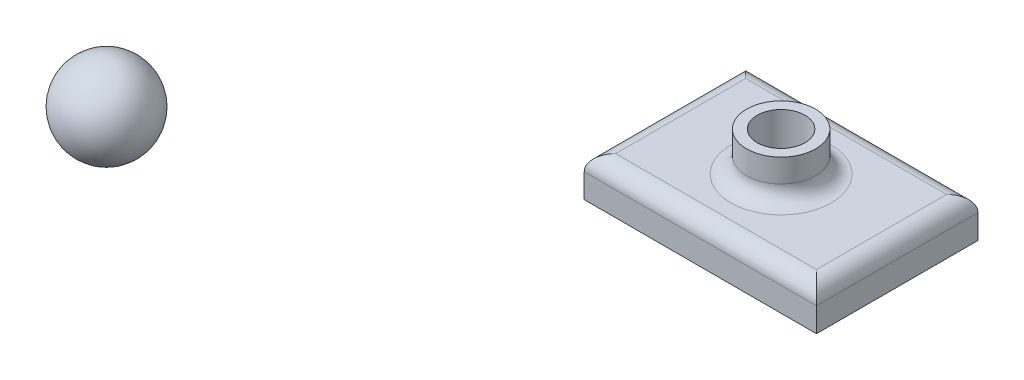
ISO-10303-21;
HEADER;
FILE_DESCRIPTION(('STEP AP214'),'2;1');
FILE_NAME('part.step','',(''),(''),'','','');
FILE_SCHEMA(('AUTOMOTIVE_DESIGN { 1 0 10303 214 1 1 1 1 }'));
ENDSEC;
DATA;
#1=APPLICATION_CONTEXT('core data for automotive mechanical design processes');
#2=APPLICATION_PROTOCOL_DEFINITION('international standard','automotive_design',2000,#1);
#3=PRODUCT_CONTEXT('',#1,'mechanical');
#4=PRODUCT('Part','Part','',(#3));
#5=PRODUCT_RELATED_PRODUCT_CATEGORY('part','',(#4));
#6=PRODUCT_DEFINITION_FORMATION('','',#4);
#7=PRODUCT_DEFINITION_CONTEXT('part definition',#1,'design');
#8=PRODUCT_DEFINITION('design','',#6,#7);
#9=PRODUCT_DEFINITION_SHAPE('','',#8);
#10=(LENGTH_UNIT() NAMED_UNIT(*) SI_UNIT(.MILLI.,.METRE.));
#11=(NAMED_UNIT(*) PLANE_ANGLE_UNIT() SI_UNIT($,.RADIAN.));
#12=(NAMED_UNIT(*) SI_UNIT($,.STERADIAN.) SOLID_ANGLE_UNIT());
#13=UNCERTAINTY_MEASURE_WITH_UNIT(LENGTH_MEASURE(1.E-05),#10,'distance_accuracy_value','');
#14=(GEOMETRIC_REPRESENTATION_CONTEXT(3) GLOBAL_UNCERTAINTY_ASSIGNED_CONTEXT((#13)) GLOBAL_UNIT_ASSIGNED_CONTEXT((#10,
#11,#12)) REPRESENTATION_CONTEXT('',''));
#15=CARTESIAN_POINT('',(0.,0.,0.));
#16=DIRECTION('',(0.,0.,1.));
#17=DIRECTION('',(1.,0.,0.));
#18=AXIS2_PLACEMENT_3D('',#15,#16,#17);
#19=CARTESIAN_POINT('',(223.466392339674,32.258,-293.233369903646));
#20=DIRECTION('',(0.,-1.,0.));
#21=DIRECTION('',(0.,0.,-1.));
#22=AXIS2_PLACEMENT_3D('',#19,#20,#21);
#23=PLANE('',#22);
#24=CARTESIAN_POINT('',(317.335366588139,32.258,-227.948089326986));
#25=DIRECTION('',(0.,-1.,0.));
#26=DIRECTION('',(0.,0.,-1.));
#27=AXIS2_PLACEMENT_3D('',#24,#25,#26);
#28=CIRCLE('',#27,40.5617104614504);
#29=CARTESIAN_POINT('',(317.335366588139,32.258,-268.509799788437));
#30=VERTEX_POINT('',#29);
#31=EDGE_CURVE('E136',#30,#30,#28,.T.);
#32=ORIENTED_EDGE('',*,*,#31,.T.);
#33=EDGE_LOOP('',(#32));
#34=FACE_BOUND('',#33,.T.);
#35=DIRECTION('',(0.,0.,-1.));
#36=VECTOR('',#35,1.);
#37=CARTESIAN_POINT('',(398.504340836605,32.258,-293.233369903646));
#38=LINE('',#37,#36);
#39=CARTESIAN_POINT('',(398.504340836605,32.258,-175.362808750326));
#40=VERTEX_POINT('',#39);
#41=CARTESIAN_POINT('',(398.504340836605,32.258,-280.533369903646));
#42=VERTEX_POINT('',#41);
#43=EDGE_CURVE('E131',#40,#42,#38,.T.);
#44=ORIENTED_EDGE('',*,*,#43,.T.);
#45=DIRECTION('',(-1.,0.,0.));
#46=VECTOR('',#45,1.);
#47=CARTESIAN_POINT('',(223.466392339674,32.258,-280.533369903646));
#48=LINE('',#47,#46);
#49=CARTESIAN_POINT('',(236.166392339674,32.258,-280.533369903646));
#50=VERTEX_POINT('',#49);
#51=EDGE_CURVE('E133',#42,#50,#48,.T.);
#52=ORIENTED_EDGE('',*,*,#51,.T.);
#53=DIRECTION('',(0.,0.,1.));
#54=VECTOR('',#53,1.);
#55=CARTESIAN_POINT('',(236.166392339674,32.258,-293.233369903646));
#56=LINE('',#55,#54);
#57=CARTESIAN_POINT('',(236.166392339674,32.258,-175.362808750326));
#58=VERTEX_POINT('',#57);
#59=EDGE_CURVE('E127',#50,#58,#56,.T.);
#60=ORIENTED_EDGE('',*,*,#59,.T.);
#61=DIRECTION('',(1.,0.,0.));
#62=VECTOR('',#61,1.);
#63=CARTESIAN_POINT('',(223.466392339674,32.258,-175.362808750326));
#64=LINE('',#63,#62);
#65=EDGE_CURVE('E129',#58,#40,#64,.T.);
#66=ORIENTED_EDGE('',*,*,#65,.T.);
#67=EDGE_LOOP('',(#44,#52,#60,#66));
#68=FACE_BOUND('',#67,.T.);
#69=ADVANCED_FACE('F37',(#34,#68),#23,.F.);
#70=CARTESIAN_POINT('',(223.466392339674,32.258,-162.662808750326));
#71=DIRECTION('',(1.,0.,0.));
#72=DIRECTION('',(0.,0.,-1.));
#73=AXIS2_PLACEMENT_3D('',#70,#71,#72);
#74=PLANE('',#73);
#75=DIRECTION('',(0.,-1.,0.));
#76=VECTOR('',#75,1.);
#77=CARTESIAN_POINT('',(223.466392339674,32.258,-162.662808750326));
#78=LINE('',#77,#76);
#79=CARTESIAN_POINT('',(223.466392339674,19.558,-162.662808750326));
#80=VERTEX_POINT('',#79);
#81=CARTESIAN_POINT('',(223.466392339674,0.,-162.662808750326));
#82=VERTEX_POINT('',#81);
#83=EDGE_CURVE('E89',#80,#82,#78,.T.);
#84=ORIENTED_EDGE('',*,*,#83,.F.);
#85=DIRECTION('',(0.,0.,1.));
#86=VECTOR('',#85,1.);
#87=CARTESIAN_POINT('',(223.466392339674,19.558,-162.662808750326));
#88=LINE('',#87,#86);
#89=CARTESIAN_POINT('',(223.466392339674,19.558,-293.233369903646));
#90=VERTEX_POINT('',#89);
#91=EDGE_CURVE('E12',#80,#90,#88,.F.);
#92=ORIENTED_EDGE('',*,*,#91,.T.);
#93=DIRECTION('',(0.,-1.,0.));
#94=VECTOR('',#93,1.);
#95=CARTESIAN_POINT('',(223.466392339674,32.258,-293.233369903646));
#96=LINE('',#95,#94);
#97=CARTESIAN_POINT('',(223.466392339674,0.,-293.233369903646));
#98=VERTEX_POINT('',#97);
#99=EDGE_CURVE('E110',#90,#98,#96,.T.);
#100=ORIENTED_EDGE('',*,*,#99,.T.);
#101=DIRECTION('',(0.,0.,1.));
#102=VECTOR('',#101,1.);
#103=CARTESIAN_POINT('',(223.466392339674,0.,-162.662808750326));
#104=LINE('',#103,#102);
#105=EDGE_CURVE('E104',#98,#82,#104,.T.);
#106=ORIENTED_EDGE('',*,*,#105,.T.);
#107=EDGE_LOOP('',(#84,#92,#100,#106));
#108=FACE_BOUND('',#107,.T.);
#109=ADVANCED_FACE('F108',(#108),#74,.F.);
#110=CARTESIAN_POINT('',(223.466392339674,32.258,-162.662808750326));
#111=DIRECTION('',(0.,0.,-1.));
#112=DIRECTION('',(-1.,0.,0.));
#113=AXIS2_PLACEMENT_3D('',#110,#111,#112);
#114=PLANE('',#113);
#115=DIRECTION('',(0.,-1.,0.));
#116=VECTOR('',#115,1.);
#117=CARTESIAN_POINT('',(411.204340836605,32.258,-162.662808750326));
#118=LINE('',#117,#116);
#119=CARTESIAN_POINT('',(411.204340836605,19.558,-162.662808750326));
#120=VERTEX_POINT('',#119);
#121=CARTESIAN_POINT('',(411.204340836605,0.,-162.662808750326));
#122=VERTEX_POINT('',#121);
#123=EDGE_CURVE('E98',#120,#122,#118,.T.);
#124=ORIENTED_EDGE('',*,*,#123,.F.);
#125=DIRECTION('',(1.,0.,0.));
#126=VECTOR('',#125,1.);
#127=CARTESIAN_POINT('',(223.466392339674,19.558,-162.662808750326));
#128=LINE('',#127,#126);
#129=EDGE_CURVE('E46',#120,#80,#128,.F.);
#130=ORIENTED_EDGE('',*,*,#129,.T.);
#131=ORIENTED_EDGE('',*,*,#83,.T.);
#132=DIRECTION('',(1.,0.,0.));
#133=VECTOR('',#132,1.);
#134=CARTESIAN_POINT('',(223.466392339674,0.,-162.662808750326));
#135=LINE('',#134,#133);
#136=EDGE_CURVE('E92',#82,#122,#135,.T.);
#137=ORIENTED_EDGE('',*,*,#136,.T.);
#138=EDGE_LOOP('',(#124,#130,#131,#137));
#139=FACE_BOUND('',#138,.T.);
#140=ADVANCED_FACE('F91',(#139),#114,.F.);
#141=CARTESIAN_POINT('',(411.204340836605,32.258,-162.662808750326));
#142=DIRECTION('',(-1.,0.,0.));
#143=DIRECTION('',(0.,0.,1.));
#144=AXIS2_PLACEMENT_3D('',#141,#142,#143);
#145=PLANE('',#144);
#146=DIRECTION('',(0.,-1.,0.));
#147=VECTOR('',#146,1.);
#148=CARTESIAN_POINT('',(411.204340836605,32.258,-293.233369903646));
#149=LINE('',#148,#147);
#150=CARTESIAN_POINT('',(411.204340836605,19.558,-293.233369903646));
#151=VERTEX_POINT('',#150);
#152=CARTESIAN_POINT('',(411.204340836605,0.,-293.233369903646));
#153=VERTEX_POINT('',#152);
#154=EDGE_CURVE('E122',#151,#153,#149,.T.);
#155=ORIENTED_EDGE('',*,*,#154,.F.);
#156=DIRECTION('',(0.,0.,-1.));
#157=VECTOR('',#156,1.);
#158=CARTESIAN_POINT('',(411.204340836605,19.558,-162.662808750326));
#159=LINE('',#158,#157);
#160=EDGE_CURVE('E61',#151,#120,#159,.F.);
#161=ORIENTED_EDGE('',*,*,#160,.T.);
#162=ORIENTED_EDGE('',*,*,#123,.T.);
#163=DIRECTION('',(0.,0.,-1.));
#164=VECTOR('',#163,1.);
#165=CARTESIAN_POINT('',(411.204340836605,0.,-162.662808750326));
#166=LINE('',#165,#164);
#167=EDGE_CURVE('E106',#122,#153,#166,.T.);
#168=ORIENTED_EDGE('',*,*,#167,.T.);
#169=EDGE_LOOP('',(#155,#161,#162,#168));
#170=FACE_BOUND('',#169,.T.);
#171=ADVANCED_FACE('F185',(#170),#145,.F.);
#172=CARTESIAN_POINT('',(223.466392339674,32.258,-293.233369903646));
#173=DIRECTION('',(0.,0.,1.));
#174=DIRECTION('',(1.,0.,0.));
#175=AXIS2_PLACEMENT_3D('',#172,#173,#174);
#176=PLANE('',#175);
#177=ORIENTED_EDGE('',*,*,#99,.F.);
#178=DIRECTION('',(-1.,0.,0.));
#179=VECTOR('',#178,1.);
#180=CARTESIAN_POINT('',(223.466392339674,19.558,-293.233369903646));
#181=LINE('',#180,#179);
#182=EDGE_CURVE('E139',#90,#151,#181,.F.);
#183=ORIENTED_EDGE('',*,*,#182,.T.);
#184=ORIENTED_EDGE('',*,*,#154,.T.);
#185=DIRECTION('',(-1.,0.,0.));
#186=VECTOR('',#185,1.);
#187=CARTESIAN_POINT('',(223.466392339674,0.,-293.233369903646));
#188=LINE('',#187,#186);
#189=EDGE_CURVE('E119',#153,#98,#188,.T.);
#190=ORIENTED_EDGE('',*,*,#189,.T.);
#191=EDGE_LOOP('',(#177,#183,#184,#190));
#192=FACE_BOUND('',#191,.T.);
#193=ADVANCED_FACE('F165',(#192),#176,.F.);
#194=CARTESIAN_POINT('',(223.466392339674,0.,-293.233369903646));
#195=DIRECTION('',(0.,-1.,0.));
#196=DIRECTION('',(0.,0.,-1.));
#197=AXIS2_PLACEMENT_3D('',#194,#195,#196);
#198=PLANE('',#197);
#199=ORIENTED_EDGE('',*,*,#105,.F.);
#200=ORIENTED_EDGE('',*,*,#189,.F.);
#201=ORIENTED_EDGE('',*,*,#167,.F.);
#202=ORIENTED_EDGE('',*,*,#136,.F.);
#203=EDGE_LOOP('',(#199,#200,#201,#202));
#204=FACE_BOUND('',#203,.T.);
#205=ADVANCED_FACE('F102',(#204),#198,.T.);
#206=CARTESIAN_POINT('',(317.335366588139,63.754,-227.948089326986));
#207=DIRECTION('',(0.,-1.,0.));
#208=DIRECTION('',(0.,0.,-1.));
#209=AXIS2_PLACEMENT_3D('',#206,#207,#208);
#210=CYLINDRICAL_SURFACE('',#209,27.8617104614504);
#211=CARTESIAN_POINT('',(317.335366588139,44.958,-227.948089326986));
#212=DIRECTION('',(0.,-1.,0.));
#213=DIRECTION('',(0.,0.,-1.));
#214=AXIS2_PLACEMENT_3D('',#211,#212,#213);
#215=CIRCLE('',#214,27.8617104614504);
#216=CARTESIAN_POINT('',(317.335366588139,44.958,-255.809799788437));
#217=VERTEX_POINT('',#216);
#218=EDGE_CURVE('E97',#217,#217,#215,.F.);
#219=ORIENTED_EDGE('',*,*,#218,.T.);
#220=EDGE_LOOP('',(#219));
#221=FACE_BOUND('',#220,.T.);
#222=CARTESIAN_POINT('',(317.335366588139,63.754,-227.948089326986));
#223=DIRECTION('',(0.,1.,0.));
#224=DIRECTION('',(0.,0.,1.));
#225=AXIS2_PLACEMENT_3D('',#222,#223,#224);
#226=CIRCLE('',#225,27.8617104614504);
#227=CARTESIAN_POINT('',(317.335366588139,63.754,-200.086378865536));
#228=VERTEX_POINT('',#227);
#229=EDGE_CURVE('E112',#228,#228,#226,.T.);
#230=ORIENTED_EDGE('',*,*,#229,.F.);
#231=EDGE_LOOP('',(#230));
#232=FACE_BOUND('',#231,.T.);
#233=ADVANCED_FACE('F179',(#221,#232),#210,.T.);
#234=CARTESIAN_POINT('',(317.335366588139,63.754,-227.948089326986));
#235=DIRECTION('',(0.,1.,0.));
#236=DIRECTION('',(0.,0.,1.));
#237=AXIS2_PLACEMENT_3D('',#234,#235,#236);
#238=PLANE('',#237);
#239=CARTESIAN_POINT('',(317.335366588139,63.754,-227.948089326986));
#240=DIRECTION('',(0.,1.,0.));
#241=DIRECTION('',(0.,0.,1.));
#242=AXIS2_PLACEMENT_3D('',#239,#240,#241);
#243=CIRCLE('',#242,19.2848985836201);
#244=CARTESIAN_POINT('',(317.335366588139,63.754,-208.663190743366));
#245=VERTEX_POINT('',#244);
#246=EDGE_CURVE('E296',#245,#245,#243,.T.);
#247=ORIENTED_EDGE('',*,*,#246,.F.);
#248=EDGE_LOOP('',(#247));
#249=FACE_BOUND('',#248,.T.);
#250=ORIENTED_EDGE('',*,*,#229,.T.);
#251=EDGE_LOOP('',(#250));
#252=FACE_BOUND('',#251,.T.);
#253=ADVANCED_FACE('F193',(#249,#252),#238,.T.);
#254=CARTESIAN_POINT('',(317.335366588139,44.958,-227.948089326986));
#255=DIRECTION('',(0.,-1.,0.));
#256=DIRECTION('',(0.,0.,-1.));
#257=AXIS2_PLACEMENT_3D('',#254,#255,#256);
#258=TOROIDAL_SURFACE('',#257,40.5617104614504,12.7);
#259=ORIENTED_EDGE('',*,*,#31,.F.);
#260=EDGE_LOOP('',(#259));
#261=FACE_BOUND('',#260,.T.);
#262=ORIENTED_EDGE('',*,*,#218,.F.);
#263=EDGE_LOOP('',(#262));
#264=FACE_BOUND('',#263,.T.);
#265=ADVANCED_FACE('F190',(#261,#264),#258,.F.);
#266=CARTESIAN_POINT('',(223.466392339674,19.558,-175.362808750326));
#267=DIRECTION('',(1.,0.,0.));
#268=DIRECTION('',(0.,0.,-1.));
#269=AXIS2_PLACEMENT_3D('',#266,#267,#268);
#270=CYLINDRICAL_SURFACE('',#269,12.7);
#271=CARTESIAN_POINT('',(236.166392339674,19.558,-175.362808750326));
#272=DIRECTION('',(0.707106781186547,0.,0.707106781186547));
#273=DIRECTION('',(-0.707106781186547,0.,0.707106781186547));
#274=AXIS2_PLACEMENT_3D('',#271,#272,#273);
#275=ELLIPSE('',#274,17.9605122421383,12.7);
#276=EDGE_CURVE('E148',#80,#58,#275,.F.);
#277=ORIENTED_EDGE('',*,*,#276,.F.);
#278=ORIENTED_EDGE('',*,*,#129,.F.);
#279=CARTESIAN_POINT('',(398.504340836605,19.558,-175.362808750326));
#280=DIRECTION('',(0.707106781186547,0.,-0.707106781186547));
#281=DIRECTION('',(0.707106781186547,0.,0.707106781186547));
#282=AXIS2_PLACEMENT_3D('',#279,#280,#281);
#283=ELLIPSE('',#282,17.9605122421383,12.7);
#284=EDGE_CURVE('E41',#40,#120,#283,.T.);
#285=ORIENTED_EDGE('',*,*,#284,.F.);
#286=ORIENTED_EDGE('',*,*,#65,.F.);
#287=EDGE_LOOP('',(#277,#278,#285,#286));
#288=FACE_BOUND('',#287,.T.);
#289=ADVANCED_FACE('F39',(#288),#270,.T.);
#290=CARTESIAN_POINT('',(398.504340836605,19.558,-293.233369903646));
#291=DIRECTION('',(0.,0.,-1.));
#292=DIRECTION('',(-1.,0.,0.));
#293=AXIS2_PLACEMENT_3D('',#290,#291,#292);
#294=CYLINDRICAL_SURFACE('',#293,12.7);
#295=ORIENTED_EDGE('',*,*,#284,.T.);
#296=ORIENTED_EDGE('',*,*,#160,.F.);
#297=CARTESIAN_POINT('',(398.504340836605,19.558,-280.533369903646));
#298=DIRECTION('',(-0.707106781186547,0.,-0.707106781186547));
#299=DIRECTION('',(0.707106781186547,0.,-0.707106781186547));
#300=AXIS2_PLACEMENT_3D('',#297,#298,#299);
#301=ELLIPSE('',#300,17.9605122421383,12.7);
#302=EDGE_CURVE('E146',#42,#151,#301,.T.);
#303=ORIENTED_EDGE('',*,*,#302,.F.);
#304=ORIENTED_EDGE('',*,*,#43,.F.);
#305=EDGE_LOOP('',(#295,#296,#303,#304));
#306=FACE_BOUND('',#305,.T.);
#307=ADVANCED_FACE('F157',(#306),#294,.T.);
#308=CARTESIAN_POINT('',(236.166392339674,19.558,-293.233369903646));
#309=DIRECTION('',(0.,0.,1.));
#310=DIRECTION('',(1.,0.,0.));
#311=AXIS2_PLACEMENT_3D('',#308,#309,#310);
#312=CYLINDRICAL_SURFACE('',#311,12.7);
#313=ORIENTED_EDGE('',*,*,#276,.T.);
#314=ORIENTED_EDGE('',*,*,#59,.F.);
#315=CARTESIAN_POINT('',(236.166392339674,19.558,-280.533369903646));
#316=DIRECTION('',(-0.707106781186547,0.,0.707106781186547));
#317=DIRECTION('',(0.707106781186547,0.,0.707106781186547));
#318=AXIS2_PLACEMENT_3D('',#315,#316,#317);
#319=ELLIPSE('',#318,17.9605122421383,12.7);
#320=EDGE_CURVE('E144',#90,#50,#319,.F.);
#321=ORIENTED_EDGE('',*,*,#320,.F.);
#322=ORIENTED_EDGE('',*,*,#91,.F.);
#323=EDGE_LOOP('',(#313,#314,#321,#322));
#324=FACE_BOUND('',#323,.T.);
#325=ADVANCED_FACE('F162',(#324),#312,.T.);
#326=CARTESIAN_POINT('',(223.466392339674,19.558,-280.533369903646));
#327=DIRECTION('',(-1.,0.,0.));
#328=DIRECTION('',(0.,0.,1.));
#329=AXIS2_PLACEMENT_3D('',#326,#327,#328);
#330=CYLINDRICAL_SURFACE('',#329,12.7);
#331=ORIENTED_EDGE('',*,*,#302,.T.);
#332=ORIENTED_EDGE('',*,*,#182,.F.);
#333=ORIENTED_EDGE('',*,*,#320,.T.);
#334=ORIENTED_EDGE('',*,*,#51,.F.);
#335=EDGE_LOOP('',(#331,#332,#333,#334));
#336=FACE_BOUND('',#335,.T.);
#337=ADVANCED_FACE('F167',(#336),#330,.T.);
#338=CARTESIAN_POINT('',(317.335366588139,32.258,-227.948089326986));
#339=DIRECTION('',(0.,1.,0.));
#340=DIRECTION('',(0.,0.,1.));
#341=AXIS2_PLACEMENT_3D('',#338,#339,#340);
#342=CYLINDRICAL_SURFACE('',#341,19.2848985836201);
#343=CARTESIAN_POINT('',(317.335366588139,32.258,-227.948089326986));
#344=DIRECTION('',(0.,1.,0.));
#345=DIRECTION('',(0.,0.,1.));
#346=AXIS2_PLACEMENT_3D('',#343,#344,#345);
#347=CIRCLE('',#346,19.2848985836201);
#348=CARTESIAN_POINT('',(317.335366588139,32.258,-208.663190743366));
#349=VERTEX_POINT('',#348);
#350=EDGE_CURVE('E147',#349,#349,#347,.T.);
#351=ORIENTED_EDGE('',*,*,#350,.F.);
#352=EDGE_LOOP('',(#351));
#353=FACE_BOUND('',#352,.T.);
#354=ORIENTED_EDGE('',*,*,#246,.T.);
#355=EDGE_LOOP('',(#354));
#356=FACE_BOUND('',#355,.T.);
#357=ADVANCED_FACE('F197',(#353,#356),#342,.F.);
#358=CARTESIAN_POINT('',(317.335366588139,32.258,-227.948089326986));
#359=DIRECTION('',(0.,1.,0.));
#360=DIRECTION('',(0.,0.,1.));
#361=AXIS2_PLACEMENT_3D('',#358,#359,#360);
#362=PLANE('',#361);
#363=ORIENTED_EDGE('',*,*,#350,.T.);
#364=EDGE_LOOP('',(#363));
#365=FACE_BOUND('',#364,.T.);
#366=ADVANCED_FACE('F279',(#365),#362,.T.);
#367=CLOSED_SHELL('',(#69,#109,#140,#171,#193,#205,#233,#253,#265,#289,#307,#325,#337,#357,#366));
#368=MANIFOLD_SOLID_BREP('B2',#367);
#369=CARTESIAN_POINT('',(0.,34.602640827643,0.));
#370=DIRECTION('',(0.,1.,0.));
#371=DIRECTION('',(-1.,0.,0.));
#372=AXIS2_PLACEMENT_3D('',#369,#370,#371);
#373=SPHERICAL_SURFACE('',#372,34.602640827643);
#374=CARTESIAN_POINT('',(0.,69.2052816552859,0.));
#375=VERTEX_POINT('',#374);
#376=VERTEX_LOOP('',#375);
#377=FACE_BOUND('',#376,.T.);
#378=ADVANCED_FACE('F316',(#377),#373,.T.);
#379=CLOSED_SHELL('',(#378));
#380=MANIFOLD_SOLID_BREP('B6',#379);
#381=ADVANCED_BREP_SHAPE_REPRESENTATION('',(#18,#368,#380),#14);
#382=SHAPE_DEFINITION_REPRESENTATION(#9,#381);
ENDSEC;
END-ISO-10303-21;
